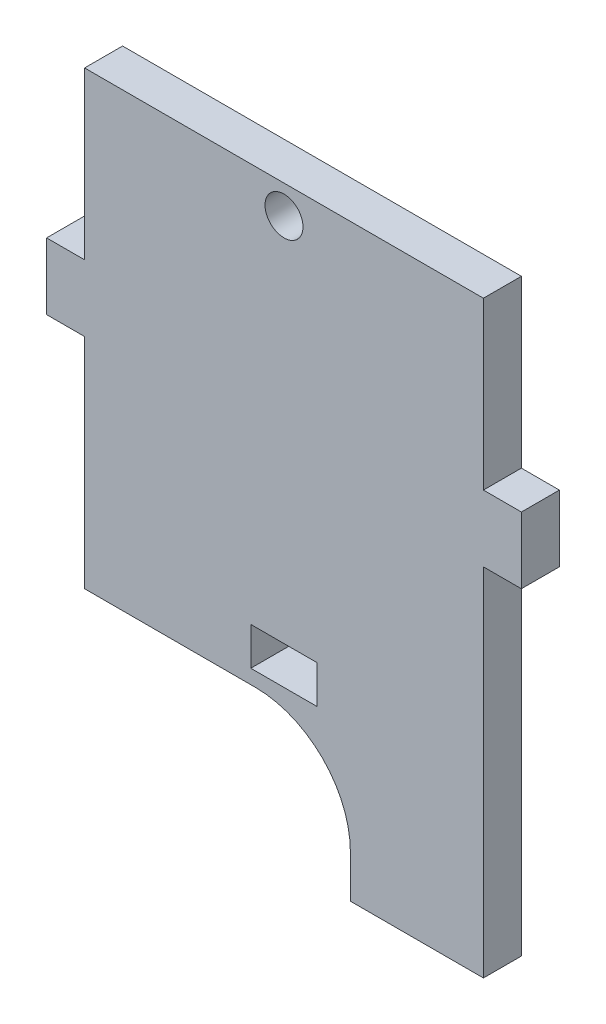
ISO-10303-21;
HEADER;
FILE_DESCRIPTION(('STEP AP214'),'2;1');
FILE_NAME('part.step','',(''),(''),'','','');
FILE_SCHEMA(('AUTOMOTIVE_DESIGN { 1 0 10303 214 1 1 1 1 }'));
ENDSEC;
DATA;
#1=APPLICATION_CONTEXT('core data for automotive mechanical design processes');
#2=APPLICATION_PROTOCOL_DEFINITION('international standard','automotive_design',2000,#1);
#3=PRODUCT_CONTEXT('',#1,'mechanical');
#4=PRODUCT('Part','Part','',(#3));
#5=PRODUCT_RELATED_PRODUCT_CATEGORY('part','',(#4));
#6=PRODUCT_DEFINITION_FORMATION('','',#4);
#7=PRODUCT_DEFINITION_CONTEXT('part definition',#1,'design');
#8=PRODUCT_DEFINITION('design','',#6,#7);
#9=PRODUCT_DEFINITION_SHAPE('','',#8);
#10=(LENGTH_UNIT() NAMED_UNIT(*) SI_UNIT(.MILLI.,.METRE.));
#11=(NAMED_UNIT(*) PLANE_ANGLE_UNIT() SI_UNIT($,.RADIAN.));
#12=(NAMED_UNIT(*) SI_UNIT($,.STERADIAN.) SOLID_ANGLE_UNIT());
#13=UNCERTAINTY_MEASURE_WITH_UNIT(LENGTH_MEASURE(1.E-05),#10,'distance_accuracy_value','');
#14=(GEOMETRIC_REPRESENTATION_CONTEXT(3) GLOBAL_UNCERTAINTY_ASSIGNED_CONTEXT((#13)) GLOBAL_UNIT_ASSIGNED_CONTEXT((#10,
#11,#12)) REPRESENTATION_CONTEXT('',''));
#15=CARTESIAN_POINT('',(0.,0.,0.));
#16=DIRECTION('',(0.,0.,1.));
#17=DIRECTION('',(1.,0.,0.));
#18=AXIS2_PLACEMENT_3D('',#15,#16,#17);
#19=CARTESIAN_POINT('',(8.44111376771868,0.,4.));
#20=DIRECTION('',(1.,0.,0.));
#21=DIRECTION('',(0.,1.,0.));
#22=AXIS2_PLACEMENT_3D('',#19,#20,#21);
#23=PLANE('',#22);
#24=DIRECTION('',(0.,-1.,0.));
#25=VECTOR('',#24,1.);
#26=CARTESIAN_POINT('',(8.44111376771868,0.,4.));
#27=LINE('',#26,#25);
#28=CARTESIAN_POINT('',(8.44111376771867,-50.8647060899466,4.));
#29=VERTEX_POINT('',#28);
#30=CARTESIAN_POINT('',(8.44111376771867,-55.3647060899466,4.));
#31=VERTEX_POINT('',#30);
#32=EDGE_CURVE('E322',#29,#31,#27,.T.);
#33=ORIENTED_EDGE('',*,*,#32,.F.);
#34=DIRECTION('',(0.,0.,-1.));
#35=VECTOR('',#34,1.);
#36=CARTESIAN_POINT('',(8.44111376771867,-50.8647060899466,0.));
#37=LINE('',#36,#35);
#38=CARTESIAN_POINT('',(8.44111376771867,-50.8647060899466,0.));
#39=VERTEX_POINT('',#38);
#40=EDGE_CURVE('E311',#29,#39,#37,.T.);
#41=ORIENTED_EDGE('',*,*,#40,.T.);
#42=DIRECTION('',(0.,-1.,0.));
#43=VECTOR('',#42,1.);
#44=CARTESIAN_POINT('',(8.44111376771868,0.,0.));
#45=LINE('',#44,#43);
#46=CARTESIAN_POINT('',(8.44111376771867,-55.3647060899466,0.));
#47=VERTEX_POINT('',#46);
#48=EDGE_CURVE('E320',#39,#47,#45,.T.);
#49=ORIENTED_EDGE('',*,*,#48,.T.);
#50=DIRECTION('',(0.,0.,-1.));
#51=VECTOR('',#50,1.);
#52=CARTESIAN_POINT('',(8.44111376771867,-55.3647060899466,4.));
#53=LINE('',#52,#51);
#54=EDGE_CURVE('E287',#31,#47,#53,.T.);
#55=ORIENTED_EDGE('',*,*,#54,.F.);
#56=EDGE_LOOP('',(#33,#41,#49,#55));
#57=FACE_BOUND('',#56,.T.);
#58=ADVANCED_FACE('F95',(#57),#23,.F.);
#59=CARTESIAN_POINT('',(-2.04888623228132,0.,4.));
#60=DIRECTION('',(1.,0.,0.));
#61=DIRECTION('',(0.,0.,-1.));
#62=AXIS2_PLACEMENT_3D('',#59,#60,#61);
#63=PLANE('',#62);
#64=DIRECTION('',(0.,-1.,0.));
#65=VECTOR('',#64,1.);
#66=CARTESIAN_POINT('',(-2.04888623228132,0.,0.));
#67=LINE('',#66,#65);
#68=CARTESIAN_POINT('',(-2.04888623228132,-35.3647060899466,0.));
#69=VERTEX_POINT('',#68);
#70=CARTESIAN_POINT('',(-2.04888623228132,-39.3647060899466,0.));
#71=VERTEX_POINT('',#70);
#72=EDGE_CURVE('E329',#69,#71,#67,.T.);
#73=ORIENTED_EDGE('',*,*,#72,.F.);
#74=DIRECTION('',(0.,0.,-1.));
#75=VECTOR('',#74,1.);
#76=CARTESIAN_POINT('',(-2.04888623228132,-35.3647060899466,4.));
#77=LINE('',#76,#75);
#78=CARTESIAN_POINT('',(-2.04888623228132,-35.3647060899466,4.));
#79=VERTEX_POINT('',#78);
#80=EDGE_CURVE('E357',#79,#69,#77,.T.);
#81=ORIENTED_EDGE('',*,*,#80,.F.);
#82=DIRECTION('',(0.,-1.,0.));
#83=VECTOR('',#82,1.);
#84=CARTESIAN_POINT('',(-2.04888623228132,0.,4.));
#85=LINE('',#84,#83);
#86=CARTESIAN_POINT('',(-2.04888623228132,-39.3647060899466,4.));
#87=VERTEX_POINT('',#86);
#88=EDGE_CURVE('E245',#79,#87,#85,.T.);
#89=ORIENTED_EDGE('',*,*,#88,.T.);
#90=DIRECTION('',(0.,0.,-1.));
#91=VECTOR('',#90,1.);
#92=CARTESIAN_POINT('',(-2.04888623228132,-39.3647060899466,4.));
#93=LINE('',#92,#91);
#94=EDGE_CURVE('E257',#87,#71,#93,.T.);
#95=ORIENTED_EDGE('',*,*,#94,.T.);
#96=EDGE_LOOP('',(#73,#81,#89,#95));
#97=FACE_BOUND('',#96,.T.);
#98=ADVANCED_FACE('F362',(#97),#63,.T.);
#99=CARTESIAN_POINT('',(0.,-39.3647060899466,4.));
#100=DIRECTION('',(0.,1.,0.));
#101=DIRECTION('',(0.,0.,1.));
#102=AXIS2_PLACEMENT_3D('',#99,#100,#101);
#103=PLANE('',#102);
#104=DIRECTION('',(1.,0.,0.));
#105=VECTOR('',#104,1.);
#106=CARTESIAN_POINT('',(0.,-39.3647060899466,0.));
#107=LINE('',#106,#105);
#108=CARTESIAN_POINT('',(4.95111376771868,-39.3647060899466,0.));
#109=VERTEX_POINT('',#108);
#110=EDGE_CURVE('E334',#71,#109,#107,.T.);
#111=ORIENTED_EDGE('',*,*,#110,.F.);
#112=ORIENTED_EDGE('',*,*,#94,.F.);
#113=DIRECTION('',(1.,0.,0.));
#114=VECTOR('',#113,1.);
#115=CARTESIAN_POINT('',(0.,-39.3647060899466,4.));
#116=LINE('',#115,#114);
#117=CARTESIAN_POINT('',(4.95111376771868,-39.3647060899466,4.));
#118=VERTEX_POINT('',#117);
#119=EDGE_CURVE('E237',#87,#118,#116,.T.);
#120=ORIENTED_EDGE('',*,*,#119,.T.);
#121=DIRECTION('',(0.,0.,-1.));
#122=VECTOR('',#121,1.);
#123=CARTESIAN_POINT('',(4.95111376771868,-39.3647060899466,4.));
#124=LINE('',#123,#122);
#125=EDGE_CURVE('E233',#118,#109,#124,.T.);
#126=ORIENTED_EDGE('',*,*,#125,.T.);
#127=EDGE_LOOP('',(#111,#112,#120,#126));
#128=FACE_BOUND('',#127,.T.);
#129=ADVANCED_FACE('F365',(#128),#103,.T.);
#130=CARTESIAN_POINT('',(4.95111376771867,0.,4.));
#131=DIRECTION('',(1.,0.,0.));
#132=DIRECTION('',(0.,1.,0.));
#133=AXIS2_PLACEMENT_3D('',#130,#131,#132);
#134=PLANE('',#133);
#135=DIRECTION('',(0.,-1.,0.));
#136=VECTOR('',#135,1.);
#137=CARTESIAN_POINT('',(4.95111376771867,0.,0.));
#138=LINE('',#137,#136);
#139=CARTESIAN_POINT('',(4.95111376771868,-35.3647060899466,0.));
#140=VERTEX_POINT('',#139);
#141=EDGE_CURVE('E367',#140,#109,#138,.T.);
#142=ORIENTED_EDGE('',*,*,#141,.T.);
#143=ORIENTED_EDGE('',*,*,#125,.F.);
#144=DIRECTION('',(0.,-1.,0.));
#145=VECTOR('',#144,1.);
#146=CARTESIAN_POINT('',(4.95111376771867,0.,4.));
#147=LINE('',#146,#145);
#148=CARTESIAN_POINT('',(4.95111376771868,-35.3647060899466,4.));
#149=VERTEX_POINT('',#148);
#150=EDGE_CURVE('E226',#149,#118,#147,.T.);
#151=ORIENTED_EDGE('',*,*,#150,.F.);
#152=DIRECTION('',(0.,0.,-1.));
#153=VECTOR('',#152,1.);
#154=CARTESIAN_POINT('',(4.95111376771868,-35.3647060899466,4.));
#155=LINE('',#154,#153);
#156=EDGE_CURVE('E231',#149,#140,#155,.T.);
#157=ORIENTED_EDGE('',*,*,#156,.T.);
#158=EDGE_LOOP('',(#142,#143,#151,#157));
#159=FACE_BOUND('',#158,.T.);
#160=ADVANCED_FACE('F229',(#159),#134,.F.);
#161=CARTESIAN_POINT('',(0.,-35.3647060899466,4.));
#162=DIRECTION('',(0.,1.,0.));
#163=DIRECTION('',(0.,0.,1.));
#164=AXIS2_PLACEMENT_3D('',#161,#162,#163);
#165=PLANE('',#164);
#166=DIRECTION('',(1.,0.,0.));
#167=VECTOR('',#166,1.);
#168=CARTESIAN_POINT('',(0.,-35.3647060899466,0.));
#169=LINE('',#168,#167);
#170=EDGE_CURVE('E251',#69,#140,#169,.T.);
#171=ORIENTED_EDGE('',*,*,#170,.T.);
#172=ORIENTED_EDGE('',*,*,#156,.F.);
#173=DIRECTION('',(1.,0.,0.));
#174=VECTOR('',#173,1.);
#175=CARTESIAN_POINT('',(0.,-35.3647060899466,4.));
#176=LINE('',#175,#174);
#177=EDGE_CURVE('E238',#79,#149,#176,.T.);
#178=ORIENTED_EDGE('',*,*,#177,.F.);
#179=ORIENTED_EDGE('',*,*,#80,.T.);
#180=EDGE_LOOP('',(#171,#172,#178,#179));
#181=FACE_BOUND('',#180,.T.);
#182=ADVANCED_FACE('F249',(#181),#165,.F.);
#183=CARTESIAN_POINT('',(1.45111376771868,3.63529391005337,4.));
#184=DIRECTION('',(0.,0.,-1.));
#185=DIRECTION('',(-1.,0.,0.));
#186=AXIS2_PLACEMENT_3D('',#183,#184,#185);
#187=CYLINDRICAL_SURFACE('',#186,2.);
#188=CARTESIAN_POINT('',(1.45111376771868,3.63529391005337,4.));
#189=DIRECTION('',(0.,0.,1.));
#190=DIRECTION('',(1.,0.,0.));
#191=AXIS2_PLACEMENT_3D('',#188,#189,#190);
#192=CIRCLE('',#191,2.);
#193=CARTESIAN_POINT('',(3.45111376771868,3.63529391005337,4.));
#194=VERTEX_POINT('',#193);
#195=EDGE_CURVE('E247',#194,#194,#192,.T.);
#196=ORIENTED_EDGE('',*,*,#195,.T.);
#197=EDGE_LOOP('',(#196));
#198=FACE_BOUND('',#197,.T.);
#199=CARTESIAN_POINT('',(1.45111376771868,3.63529391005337,0.));
#200=DIRECTION('',(0.,0.,1.));
#201=DIRECTION('',(1.,0.,0.));
#202=AXIS2_PLACEMENT_3D('',#199,#200,#201);
#203=CIRCLE('',#202,2.);
#204=CARTESIAN_POINT('',(3.45111376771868,3.63529391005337,0.));
#205=VERTEX_POINT('',#204);
#206=EDGE_CURVE('E281',#205,#205,#203,.T.);
#207=ORIENTED_EDGE('',*,*,#206,.F.);
#208=EDGE_LOOP('',(#207));
#209=FACE_BOUND('',#208,.T.);
#210=ADVANCED_FACE('F394',(#198,#209),#187,.F.);
#211=CARTESIAN_POINT('',(0.,-55.3647060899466,4.));
#212=DIRECTION('',(0.,1.,0.));
#213=DIRECTION('',(0.,0.,1.));
#214=AXIS2_PLACEMENT_3D('',#211,#212,#213);
#215=PLANE('',#214);
#216=DIRECTION('',(1.,0.,0.));
#217=VECTOR('',#216,1.);
#218=CARTESIAN_POINT('',(0.,-55.3647060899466,0.));
#219=LINE('',#218,#217);
#220=CARTESIAN_POINT('',(22.4511137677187,-55.3647060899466,0.));
#221=VERTEX_POINT('',#220);
#222=EDGE_CURVE('E327',#47,#221,#219,.T.);
#223=ORIENTED_EDGE('',*,*,#222,.T.);
#224=DIRECTION('',(0.,0.,-1.));
#225=VECTOR('',#224,1.);
#226=CARTESIAN_POINT('',(22.4511137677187,-55.3647060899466,4.));
#227=LINE('',#226,#225);
#228=CARTESIAN_POINT('',(22.4511137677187,-55.3647060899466,4.));
#229=VERTEX_POINT('',#228);
#230=EDGE_CURVE('E353',#229,#221,#227,.T.);
#231=ORIENTED_EDGE('',*,*,#230,.F.);
#232=DIRECTION('',(1.,0.,0.));
#233=VECTOR('',#232,1.);
#234=CARTESIAN_POINT('',(0.,-55.3647060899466,4.));
#235=LINE('',#234,#233);
#236=EDGE_CURVE('E385',#31,#229,#235,.T.);
#237=ORIENTED_EDGE('',*,*,#236,.F.);
#238=ORIENTED_EDGE('',*,*,#54,.T.);
#239=EDGE_LOOP('',(#223,#231,#237,#238));
#240=FACE_BOUND('',#239,.T.);
#241=ADVANCED_FACE('F417',(#240),#215,.F.);
#242=CARTESIAN_POINT('',(0.,6.63529391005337,4.));
#243=DIRECTION('',(0.,1.,0.));
#244=DIRECTION('',(0.,0.,1.));
#245=AXIS2_PLACEMENT_3D('',#242,#243,#244);
#246=PLANE('',#245);
#247=DIRECTION('',(1.,0.,0.));
#248=VECTOR('',#247,1.);
#249=CARTESIAN_POINT('',(0.,6.63529391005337,0.));
#250=LINE('',#249,#248);
#251=CARTESIAN_POINT('',(-19.5488862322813,6.63529391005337,0.));
#252=VERTEX_POINT('',#251);
#253=CARTESIAN_POINT('',(22.4511137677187,6.63529391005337,0.));
#254=VERTEX_POINT('',#253);
#255=EDGE_CURVE('E341',#252,#254,#250,.T.);
#256=ORIENTED_EDGE('',*,*,#255,.F.);
#257=DIRECTION('',(0.,0.,-1.));
#258=VECTOR('',#257,1.);
#259=CARTESIAN_POINT('',(-19.5488862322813,6.63529391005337,4.));
#260=LINE('',#259,#258);
#261=CARTESIAN_POINT('',(-19.5488862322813,6.63529391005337,4.));
#262=VERTEX_POINT('',#261);
#263=EDGE_CURVE('E255',#262,#252,#260,.T.);
#264=ORIENTED_EDGE('',*,*,#263,.F.);
#265=DIRECTION('',(1.,0.,0.));
#266=VECTOR('',#265,1.);
#267=CARTESIAN_POINT('',(0.,6.63529391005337,4.));
#268=LINE('',#267,#266);
#269=CARTESIAN_POINT('',(22.4511137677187,6.63529391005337,4.));
#270=VERTEX_POINT('',#269);
#271=EDGE_CURVE('E378',#262,#270,#268,.T.);
#272=ORIENTED_EDGE('',*,*,#271,.T.);
#273=DIRECTION('',(0.,0.,-1.));
#274=VECTOR('',#273,1.);
#275=CARTESIAN_POINT('',(22.4511137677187,6.63529391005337,4.));
#276=LINE('',#275,#274);
#277=EDGE_CURVE('E351',#270,#254,#276,.T.);
#278=ORIENTED_EDGE('',*,*,#277,.T.);
#279=EDGE_LOOP('',(#256,#264,#272,#278));
#280=FACE_BOUND('',#279,.T.);
#281=ADVANCED_FACE('F465',(#280),#246,.T.);
#282=CARTESIAN_POINT('',(0.,-40.8647060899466,4.));
#283=DIRECTION('',(0.,1.,0.));
#284=DIRECTION('',(0.,0.,1.));
#285=AXIS2_PLACEMENT_3D('',#282,#283,#284);
#286=PLANE('',#285);
#287=DIRECTION('',(1.,0.,0.));
#288=VECTOR('',#287,1.);
#289=CARTESIAN_POINT('',(0.,-40.8647060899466,0.));
#290=LINE('',#289,#288);
#291=CARTESIAN_POINT('',(-19.5488862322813,-40.8647060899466,0.));
#292=VERTEX_POINT('',#291);
#293=CARTESIAN_POINT('',(-1.55888623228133,-40.8647060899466,0.));
#294=VERTEX_POINT('',#293);
#295=EDGE_CURVE('E348',#292,#294,#290,.T.);
#296=ORIENTED_EDGE('',*,*,#295,.T.);
#297=DIRECTION('',(0.,0.,-1.));
#298=VECTOR('',#297,1.);
#299=CARTESIAN_POINT('',(-1.55888623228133,-40.8647060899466,4.));
#300=LINE('',#299,#298);
#301=CARTESIAN_POINT('',(-1.55888623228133,-40.8647060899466,4.));
#302=VERTEX_POINT('',#301);
#303=EDGE_CURVE('E110',#294,#302,#300,.F.);
#304=ORIENTED_EDGE('',*,*,#303,.T.);
#305=DIRECTION('',(1.,0.,0.));
#306=VECTOR('',#305,1.);
#307=CARTESIAN_POINT('',(0.,-40.8647060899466,4.));
#308=LINE('',#307,#306);
#309=CARTESIAN_POINT('',(-19.5488862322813,-40.8647060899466,4.));
#310=VERTEX_POINT('',#309);
#311=EDGE_CURVE('E358',#310,#302,#308,.T.);
#312=ORIENTED_EDGE('',*,*,#311,.F.);
#313=DIRECTION('',(0.,0.,-1.));
#314=VECTOR('',#313,1.);
#315=CARTESIAN_POINT('',(-19.5488862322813,-40.8647060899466,4.));
#316=LINE('',#315,#314);
#317=EDGE_CURVE('E252',#310,#292,#316,.T.);
#318=ORIENTED_EDGE('',*,*,#317,.T.);
#319=EDGE_LOOP('',(#296,#304,#312,#318));
#320=FACE_BOUND('',#319,.T.);
#321=ADVANCED_FACE('F407',(#320),#286,.F.);
#322=CARTESIAN_POINT('',(0.,0.,0.));
#323=DIRECTION('',(0.,0.,1.));
#324=DIRECTION('',(1.,0.,0.));
#325=AXIS2_PLACEMENT_3D('',#322,#323,#324);
#326=PLANE('',#325);
#327=ORIENTED_EDGE('',*,*,#206,.T.);
#328=EDGE_LOOP('',(#327));
#329=FACE_BOUND('',#328,.T.);
#330=ORIENTED_EDGE('',*,*,#170,.F.);
#331=ORIENTED_EDGE('',*,*,#72,.T.);
#332=ORIENTED_EDGE('',*,*,#110,.T.);
#333=ORIENTED_EDGE('',*,*,#141,.F.);
#334=EDGE_LOOP('',(#330,#331,#332,#333));
#335=FACE_BOUND('',#334,.T.);
#336=ORIENTED_EDGE('',*,*,#48,.F.);
#337=CARTESIAN_POINT('',(-1.55888623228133,-50.8647060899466,0.));
#338=DIRECTION('',(0.,0.,1.));
#339=DIRECTION('',(1.,0.,0.));
#340=AXIS2_PLACEMENT_3D('',#337,#338,#339);
#341=CIRCLE('',#340,10.);
#342=EDGE_CURVE('E103',#39,#294,#341,.T.);
#343=ORIENTED_EDGE('',*,*,#342,.T.);
#344=ORIENTED_EDGE('',*,*,#295,.F.);
#345=DIRECTION('',(0.,-1.,0.));
#346=VECTOR('',#345,1.);
#347=CARTESIAN_POINT('',(-19.5488862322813,0.,0.));
#348=LINE('',#347,#346);
#349=CARTESIAN_POINT('',(-19.5488862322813,-17.8647060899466,0.));
#350=VERTEX_POINT('',#349);
#351=EDGE_CURVE('E344',#350,#292,#348,.T.);
#352=ORIENTED_EDGE('',*,*,#351,.F.);
#353=DIRECTION('',(1.,0.,0.));
#354=VECTOR('',#353,1.);
#355=CARTESIAN_POINT('',(-23.5488862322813,-17.8647060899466,0.));
#356=LINE('',#355,#354);
#357=CARTESIAN_POINT('',(-23.5488862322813,-17.8647060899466,0.));
#358=VERTEX_POINT('',#357);
#359=EDGE_CURVE('E274',#358,#350,#356,.T.);
#360=ORIENTED_EDGE('',*,*,#359,.F.);
#361=DIRECTION('',(0.,-1.,0.));
#362=VECTOR('',#361,1.);
#363=CARTESIAN_POINT('',(-23.5488862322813,-10.8647060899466,0.));
#364=LINE('',#363,#362);
#365=CARTESIAN_POINT('',(-23.5488862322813,-10.8647060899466,0.));
#366=VERTEX_POINT('',#365);
#367=EDGE_CURVE('E265',#366,#358,#364,.T.);
#368=ORIENTED_EDGE('',*,*,#367,.F.);
#369=DIRECTION('',(1.,0.,0.));
#370=VECTOR('',#369,1.);
#371=CARTESIAN_POINT('',(-23.5488862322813,-10.8647060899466,0.));
#372=LINE('',#371,#370);
#373=CARTESIAN_POINT('',(-19.5488862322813,-10.8647060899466,0.));
#374=VERTEX_POINT('',#373);
#375=EDGE_CURVE('E271',#366,#374,#372,.T.);
#376=ORIENTED_EDGE('',*,*,#375,.T.);
#377=EDGE_CURVE('E345',#252,#374,#348,.T.);
#378=ORIENTED_EDGE('',*,*,#377,.F.);
#379=ORIENTED_EDGE('',*,*,#255,.T.);
#380=DIRECTION('',(0.,-1.,0.));
#381=VECTOR('',#380,1.);
#382=CARTESIAN_POINT('',(22.4511137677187,0.,0.));
#383=LINE('',#382,#381);
#384=CARTESIAN_POINT('',(22.4511137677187,-10.8647060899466,0.));
#385=VERTEX_POINT('',#384);
#386=EDGE_CURVE('E338',#254,#385,#383,.T.);
#387=ORIENTED_EDGE('',*,*,#386,.T.);
#388=DIRECTION('',(1.,0.,0.));
#389=VECTOR('',#388,1.);
#390=CARTESIAN_POINT('',(22.4511137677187,-10.8647060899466,0.));
#391=LINE('',#390,#389);
#392=CARTESIAN_POINT('',(26.4511137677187,-10.8647060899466,0.));
#393=VERTEX_POINT('',#392);
#394=EDGE_CURVE('E300',#385,#393,#391,.T.);
#395=ORIENTED_EDGE('',*,*,#394,.T.);
#396=DIRECTION('',(0.,-1.,0.));
#397=VECTOR('',#396,1.);
#398=CARTESIAN_POINT('',(26.4511137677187,-10.8647060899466,0.));
#399=LINE('',#398,#397);
#400=CARTESIAN_POINT('',(26.4511137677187,-17.8647060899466,0.));
#401=VERTEX_POINT('',#400);
#402=EDGE_CURVE('E303',#393,#401,#399,.T.);
#403=ORIENTED_EDGE('',*,*,#402,.T.);
#404=DIRECTION('',(1.,0.,0.));
#405=VECTOR('',#404,1.);
#406=CARTESIAN_POINT('',(22.4511137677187,-17.8647060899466,0.));
#407=LINE('',#406,#405);
#408=CARTESIAN_POINT('',(22.4511137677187,-17.8647060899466,0.));
#409=VERTEX_POINT('',#408);
#410=EDGE_CURVE('E294',#409,#401,#407,.T.);
#411=ORIENTED_EDGE('',*,*,#410,.F.);
#412=EDGE_CURVE('E331',#409,#221,#383,.T.);
#413=ORIENTED_EDGE('',*,*,#412,.T.);
#414=ORIENTED_EDGE('',*,*,#222,.F.);
#415=EDGE_LOOP('',(#336,#343,#344,#352,#360,#368,#376,#378,#379,#387,#395,#403,#411,#413,#414));
#416=FACE_BOUND('',#415,.T.);
#417=ADVANCED_FACE('F325',(#329,#335,#416),#326,.F.);
#418=CARTESIAN_POINT('',(0.,0.,4.));
#419=DIRECTION('',(0.,0.,1.));
#420=DIRECTION('',(1.,0.,0.));
#421=AXIS2_PLACEMENT_3D('',#418,#419,#420);
#422=PLANE('',#421);
#423=ORIENTED_EDGE('',*,*,#195,.F.);
#424=EDGE_LOOP('',(#423));
#425=FACE_BOUND('',#424,.T.);
#426=ORIENTED_EDGE('',*,*,#177,.T.);
#427=ORIENTED_EDGE('',*,*,#150,.T.);
#428=ORIENTED_EDGE('',*,*,#119,.F.);
#429=ORIENTED_EDGE('',*,*,#88,.F.);
#430=EDGE_LOOP('',(#426,#427,#428,#429));
#431=FACE_BOUND('',#430,.T.);
#432=ORIENTED_EDGE('',*,*,#311,.T.);
#433=CARTESIAN_POINT('',(-1.55888623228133,-50.8647060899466,4.));
#434=DIRECTION('',(0.,0.,1.));
#435=DIRECTION('',(1.,0.,0.));
#436=AXIS2_PLACEMENT_3D('',#433,#434,#435);
#437=CIRCLE('',#436,10.);
#438=EDGE_CURVE('E12',#302,#29,#437,.F.);
#439=ORIENTED_EDGE('',*,*,#438,.T.);
#440=ORIENTED_EDGE('',*,*,#32,.T.);
#441=ORIENTED_EDGE('',*,*,#236,.T.);
#442=DIRECTION('',(0.,-1.,0.));
#443=VECTOR('',#442,1.);
#444=CARTESIAN_POINT('',(22.4511137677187,0.,4.));
#445=LINE('',#444,#443);
#446=CARTESIAN_POINT('',(22.4511137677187,-17.8647060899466,4.));
#447=VERTEX_POINT('',#446);
#448=EDGE_CURVE('E384',#447,#229,#445,.T.);
#449=ORIENTED_EDGE('',*,*,#448,.F.);
#450=DIRECTION('',(1.,0.,0.));
#451=VECTOR('',#450,1.);
#452=CARTESIAN_POINT('',(22.4511137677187,-17.8647060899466,4.));
#453=LINE('',#452,#451);
#454=CARTESIAN_POINT('',(26.4511137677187,-17.8647060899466,4.));
#455=VERTEX_POINT('',#454);
#456=EDGE_CURVE('E297',#447,#455,#453,.T.);
#457=ORIENTED_EDGE('',*,*,#456,.T.);
#458=DIRECTION('',(0.,-1.,0.));
#459=VECTOR('',#458,1.);
#460=CARTESIAN_POINT('',(26.4511137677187,-10.8647060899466,4.));
#461=LINE('',#460,#459);
#462=CARTESIAN_POINT('',(26.4511137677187,-10.8647060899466,4.));
#463=VERTEX_POINT('',#462);
#464=EDGE_CURVE('E293',#463,#455,#461,.T.);
#465=ORIENTED_EDGE('',*,*,#464,.F.);
#466=DIRECTION('',(1.,0.,0.));
#467=VECTOR('',#466,1.);
#468=CARTESIAN_POINT('',(22.4511137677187,-10.8647060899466,4.));
#469=LINE('',#468,#467);
#470=CARTESIAN_POINT('',(22.4511137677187,-10.8647060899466,4.));
#471=VERTEX_POINT('',#470);
#472=EDGE_CURVE('E290',#471,#463,#469,.T.);
#473=ORIENTED_EDGE('',*,*,#472,.F.);
#474=EDGE_CURVE('E381',#270,#471,#445,.T.);
#475=ORIENTED_EDGE('',*,*,#474,.F.);
#476=ORIENTED_EDGE('',*,*,#271,.F.);
#477=DIRECTION('',(0.,-1.,0.));
#478=VECTOR('',#477,1.);
#479=CARTESIAN_POINT('',(-19.5488862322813,0.,4.));
#480=LINE('',#479,#478);
#481=CARTESIAN_POINT('',(-19.5488862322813,-10.8647060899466,4.));
#482=VERTEX_POINT('',#481);
#483=EDGE_CURVE('E374',#262,#482,#480,.T.);
#484=ORIENTED_EDGE('',*,*,#483,.T.);
#485=DIRECTION('',(1.,0.,0.));
#486=VECTOR('',#485,1.);
#487=CARTESIAN_POINT('',(-23.5488862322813,-10.8647060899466,4.));
#488=LINE('',#487,#486);
#489=CARTESIAN_POINT('',(-23.5488862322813,-10.8647060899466,4.));
#490=VERTEX_POINT('',#489);
#491=EDGE_CURVE('E261',#490,#482,#488,.T.);
#492=ORIENTED_EDGE('',*,*,#491,.F.);
#493=DIRECTION('',(0.,-1.,0.));
#494=VECTOR('',#493,1.);
#495=CARTESIAN_POINT('',(-23.5488862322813,-10.8647060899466,4.));
#496=LINE('',#495,#494);
#497=CARTESIAN_POINT('',(-23.5488862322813,-17.8647060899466,4.));
#498=VERTEX_POINT('',#497);
#499=EDGE_CURVE('E268',#490,#498,#496,.T.);
#500=ORIENTED_EDGE('',*,*,#499,.T.);
#501=DIRECTION('',(1.,0.,0.));
#502=VECTOR('',#501,1.);
#503=CARTESIAN_POINT('',(-23.5488862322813,-17.8647060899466,4.));
#504=LINE('',#503,#502);
#505=CARTESIAN_POINT('',(-19.5488862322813,-17.8647060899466,4.));
#506=VERTEX_POINT('',#505);
#507=EDGE_CURVE('E264',#498,#506,#504,.T.);
#508=ORIENTED_EDGE('',*,*,#507,.T.);
#509=EDGE_CURVE('E377',#506,#310,#480,.T.);
#510=ORIENTED_EDGE('',*,*,#509,.T.);
#511=EDGE_LOOP('',(#432,#439,#440,#441,#449,#457,#465,#473,#475,#476,#484,#492,#500,#508,#510));
#512=FACE_BOUND('',#511,.T.);
#513=ADVANCED_FACE('F242',(#425,#431,#512),#422,.T.);
#514=CARTESIAN_POINT('',(-19.5488862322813,0.,4.));
#515=DIRECTION('',(1.,0.,0.));
#516=DIRECTION('',(0.,1.,0.));
#517=AXIS2_PLACEMENT_3D('',#514,#515,#516);
#518=PLANE('',#517);
#519=ORIENTED_EDGE('',*,*,#509,.F.);
#520=DIRECTION('',(0.,0.,-1.));
#521=VECTOR('',#520,1.);
#522=CARTESIAN_POINT('',(-19.5488862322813,-17.8647060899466,4.));
#523=LINE('',#522,#521);
#524=EDGE_CURVE('E284',#506,#350,#523,.T.);
#525=ORIENTED_EDGE('',*,*,#524,.T.);
#526=ORIENTED_EDGE('',*,*,#351,.T.);
#527=ORIENTED_EDGE('',*,*,#317,.F.);
#528=EDGE_LOOP('',(#519,#525,#526,#527));
#529=FACE_BOUND('',#528,.T.);
#530=ADVANCED_FACE('F398',(#529),#518,.F.);
#531=DIRECTION('',(0.,0.,-1.));
#532=VECTOR('',#531,1.);
#533=CARTESIAN_POINT('',(-19.5488862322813,-10.8647060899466,4.));
#534=LINE('',#533,#532);
#535=EDGE_CURVE('E286',#482,#374,#534,.T.);
#536=ORIENTED_EDGE('',*,*,#535,.F.);
#537=ORIENTED_EDGE('',*,*,#483,.F.);
#538=ORIENTED_EDGE('',*,*,#263,.T.);
#539=ORIENTED_EDGE('',*,*,#377,.T.);
#540=EDGE_LOOP('',(#536,#537,#538,#539));
#541=FACE_BOUND('',#540,.T.);
#542=ADVANCED_FACE('F404',(#541),#518,.F.);
#543=CARTESIAN_POINT('',(22.4511137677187,0.,4.));
#544=DIRECTION('',(1.,0.,0.));
#545=DIRECTION('',(0.,1.,0.));
#546=AXIS2_PLACEMENT_3D('',#543,#544,#545);
#547=PLANE('',#546);
#548=ORIENTED_EDGE('',*,*,#474,.T.);
#549=DIRECTION('',(0.,0.,-1.));
#550=VECTOR('',#549,1.);
#551=CARTESIAN_POINT('',(22.4511137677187,-10.8647060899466,4.));
#552=LINE('',#551,#550);
#553=EDGE_CURVE('E289',#471,#385,#552,.T.);
#554=ORIENTED_EDGE('',*,*,#553,.T.);
#555=ORIENTED_EDGE('',*,*,#386,.F.);
#556=ORIENTED_EDGE('',*,*,#277,.F.);
#557=EDGE_LOOP('',(#548,#554,#555,#556));
#558=FACE_BOUND('',#557,.T.);
#559=ADVANCED_FACE('F460',(#558),#547,.T.);
#560=DIRECTION('',(0.,0.,-1.));
#561=VECTOR('',#560,1.);
#562=CARTESIAN_POINT('',(22.4511137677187,-17.8647060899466,4.));
#563=LINE('',#562,#561);
#564=EDGE_CURVE('E309',#447,#409,#563,.T.);
#565=ORIENTED_EDGE('',*,*,#564,.F.);
#566=ORIENTED_EDGE('',*,*,#448,.T.);
#567=ORIENTED_EDGE('',*,*,#230,.T.);
#568=ORIENTED_EDGE('',*,*,#412,.F.);
#569=EDGE_LOOP('',(#565,#566,#567,#568));
#570=FACE_BOUND('',#569,.T.);
#571=ADVANCED_FACE('F432',(#570),#547,.T.);
#572=CARTESIAN_POINT('',(-23.5488862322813,-10.8647060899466,4.));
#573=DIRECTION('',(1.,0.,0.));
#574=DIRECTION('',(0.,0.,-1.));
#575=AXIS2_PLACEMENT_3D('',#572,#573,#574);
#576=PLANE('',#575);
#577=ORIENTED_EDGE('',*,*,#367,.T.);
#578=DIRECTION('',(0.,0.,-1.));
#579=VECTOR('',#578,1.);
#580=CARTESIAN_POINT('',(-23.5488862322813,-17.8647060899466,4.));
#581=LINE('',#580,#579);
#582=EDGE_CURVE('E270',#498,#358,#581,.T.);
#583=ORIENTED_EDGE('',*,*,#582,.F.);
#584=ORIENTED_EDGE('',*,*,#499,.F.);
#585=DIRECTION('',(0.,0.,-1.));
#586=VECTOR('',#585,1.);
#587=CARTESIAN_POINT('',(-23.5488862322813,-10.8647060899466,4.));
#588=LINE('',#587,#586);
#589=EDGE_CURVE('E279',#490,#366,#588,.T.);
#590=ORIENTED_EDGE('',*,*,#589,.T.);
#591=EDGE_LOOP('',(#577,#583,#584,#590));
#592=FACE_BOUND('',#591,.T.);
#593=ADVANCED_FACE('F428',(#592),#576,.F.);
#594=CARTESIAN_POINT('',(-23.5488862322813,-17.8647060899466,4.));
#595=DIRECTION('',(0.,1.,0.));
#596=DIRECTION('',(0.,0.,1.));
#597=AXIS2_PLACEMENT_3D('',#594,#595,#596);
#598=PLANE('',#597);
#599=ORIENTED_EDGE('',*,*,#359,.T.);
#600=ORIENTED_EDGE('',*,*,#524,.F.);
#601=ORIENTED_EDGE('',*,*,#507,.F.);
#602=ORIENTED_EDGE('',*,*,#582,.T.);
#603=EDGE_LOOP('',(#599,#600,#601,#602));
#604=FACE_BOUND('',#603,.T.);
#605=ADVANCED_FACE('F431',(#604),#598,.F.);
#606=CARTESIAN_POINT('',(-23.5488862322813,-10.8647060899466,4.));
#607=DIRECTION('',(0.,1.,0.));
#608=DIRECTION('',(0.,0.,1.));
#609=AXIS2_PLACEMENT_3D('',#606,#607,#608);
#610=PLANE('',#609);
#611=ORIENTED_EDGE('',*,*,#375,.F.);
#612=ORIENTED_EDGE('',*,*,#589,.F.);
#613=ORIENTED_EDGE('',*,*,#491,.T.);
#614=ORIENTED_EDGE('',*,*,#535,.T.);
#615=EDGE_LOOP('',(#611,#612,#613,#614));
#616=FACE_BOUND('',#615,.T.);
#617=ADVANCED_FACE('F434',(#616),#610,.T.);
#618=CARTESIAN_POINT('',(26.4511137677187,-10.8647060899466,4.));
#619=DIRECTION('',(1.,0.,0.));
#620=DIRECTION('',(0.,0.,-1.));
#621=AXIS2_PLACEMENT_3D('',#618,#619,#620);
#622=PLANE('',#621);
#623=ORIENTED_EDGE('',*,*,#402,.F.);
#624=DIRECTION('',(0.,0.,-1.));
#625=VECTOR('',#624,1.);
#626=CARTESIAN_POINT('',(26.4511137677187,-10.8647060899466,4.));
#627=LINE('',#626,#625);
#628=EDGE_CURVE('E299',#463,#393,#627,.T.);
#629=ORIENTED_EDGE('',*,*,#628,.F.);
#630=ORIENTED_EDGE('',*,*,#464,.T.);
#631=DIRECTION('',(0.,0.,-1.));
#632=VECTOR('',#631,1.);
#633=CARTESIAN_POINT('',(26.4511137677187,-17.8647060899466,4.));
#634=LINE('',#633,#632);
#635=EDGE_CURVE('E275',#455,#401,#634,.T.);
#636=ORIENTED_EDGE('',*,*,#635,.T.);
#637=EDGE_LOOP('',(#623,#629,#630,#636));
#638=FACE_BOUND('',#637,.T.);
#639=ADVANCED_FACE('F441',(#638),#622,.T.);
#640=CARTESIAN_POINT('',(22.4511137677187,-10.8647060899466,4.));
#641=DIRECTION('',(0.,1.,0.));
#642=DIRECTION('',(0.,0.,1.));
#643=AXIS2_PLACEMENT_3D('',#640,#641,#642);
#644=PLANE('',#643);
#645=ORIENTED_EDGE('',*,*,#394,.F.);
#646=ORIENTED_EDGE('',*,*,#553,.F.);
#647=ORIENTED_EDGE('',*,*,#472,.T.);
#648=ORIENTED_EDGE('',*,*,#628,.T.);
#649=EDGE_LOOP('',(#645,#646,#647,#648));
#650=FACE_BOUND('',#649,.T.);
#651=ADVANCED_FACE('F438',(#650),#644,.T.);
#652=CARTESIAN_POINT('',(22.4511137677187,-17.8647060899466,4.));
#653=DIRECTION('',(0.,1.,0.));
#654=DIRECTION('',(-1.,0.,0.));
#655=AXIS2_PLACEMENT_3D('',#652,#653,#654);
#656=PLANE('',#655);
#657=ORIENTED_EDGE('',*,*,#410,.T.);
#658=ORIENTED_EDGE('',*,*,#635,.F.);
#659=ORIENTED_EDGE('',*,*,#456,.F.);
#660=ORIENTED_EDGE('',*,*,#564,.T.);
#661=EDGE_LOOP('',(#657,#658,#659,#660));
#662=FACE_BOUND('',#661,.T.);
#663=ADVANCED_FACE('F443',(#662),#656,.F.);
#664=CARTESIAN_POINT('',(-1.55888623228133,-50.8647060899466,4.));
#665=DIRECTION('',(0.,0.,1.));
#666=DIRECTION('',(1.,0.,0.));
#667=AXIS2_PLACEMENT_3D('',#664,#665,#666);
#668=CYLINDRICAL_SURFACE('',#667,10.);
#669=ORIENTED_EDGE('',*,*,#438,.F.);
#670=ORIENTED_EDGE('',*,*,#303,.F.);
#671=ORIENTED_EDGE('',*,*,#342,.F.);
#672=ORIENTED_EDGE('',*,*,#40,.F.);
#673=EDGE_LOOP('',(#669,#670,#671,#672));
#674=FACE_BOUND('',#673,.T.);
#675=ADVANCED_FACE('F97',(#674),#668,.F.);
#676=CLOSED_SHELL('',(#58,#98,#129,#160,#182,#210,#241,#281,#321,#417,#513,#530,#542,#559,#571,
#593,#605,#617,#639,#651,#663,#675));
#677=MANIFOLD_SOLID_BREP('B2',#676);
#678=ADVANCED_BREP_SHAPE_REPRESENTATION('',(#18,#677),#14);
#679=SHAPE_DEFINITION_REPRESENTATION(#9,#678);
ENDSEC;
END-ISO-10303-21;
